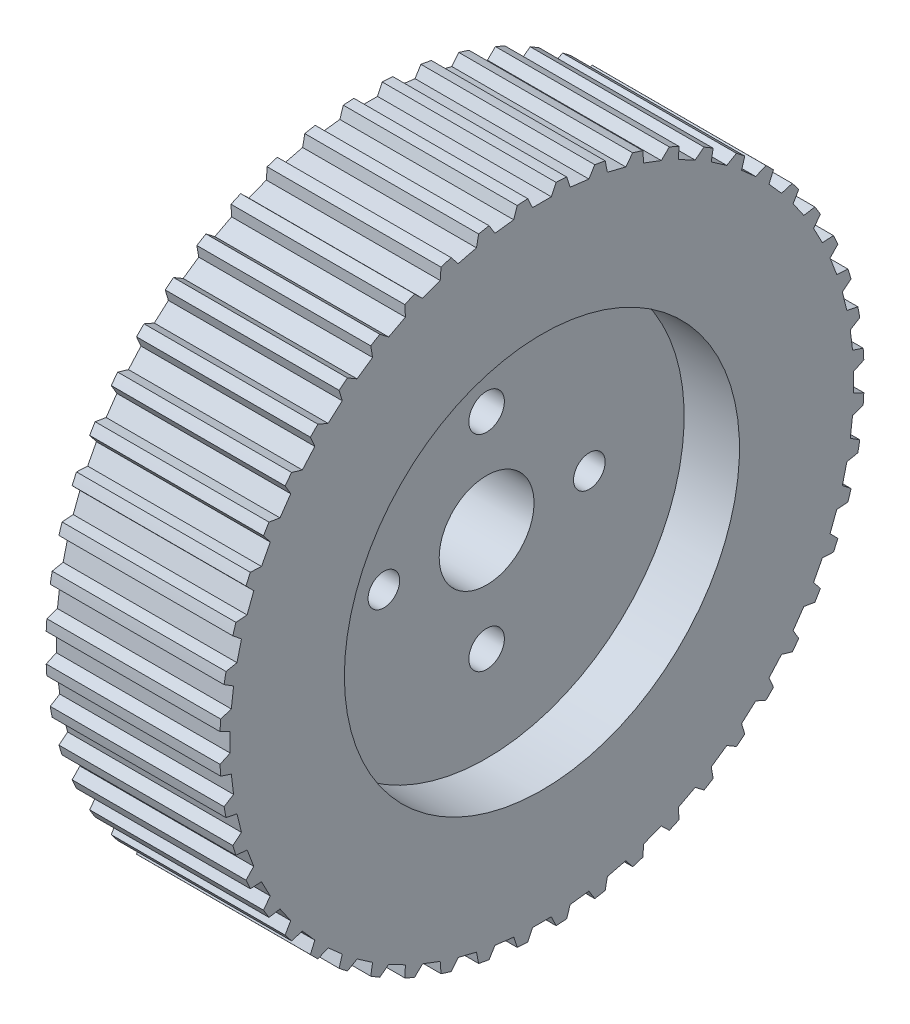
from build123d import *

# Parameters (mm, degrees)
ESQUISSE2_R                  = 2.25
ESQUISSE2_R_2                = 2
ENL_V_MAT_EXTRU_1_DEPTH      = 62.712120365
ENL_V_MAT_EXTRU_2_DEPTH      = 62.712120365
R_P_TITION_CIRCULAIRE1_COUNT = 52


with BuildPart() as part:
    # Esquisse1 → R_volution1 (revolve)
    with BuildSketch(Plane.XY, mode=Mode.PRIVATE) as r_volution1_sk:
        Polygon((0, 25), (7, 25), (7, 40.77), (-15, 40.77), (-15, 6), (0, 6), align=None)
    revolve(r_volution1_sk.sketch.rotate(Axis((-40.008180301, 0, 0), (1, 0, 0)), 90), axis=Axis((-40.008180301, 0, 0), (1, 0, 0)))

    # Esquisse2 → Enl_v. mat.-Extru.1 (cut, through all)
    with BuildSketch(Plane.ZY.offset(15)):
        with Locations((0, 13)):
            Circle(ESQUISSE2_R)
        with Locations((13, 0)):
            Circle(ESQUISSE2_R_2)
        with Locations((0, -13)):
            Circle(ESQUISSE2_R)
        with Locations((-13, 0)):
            Circle(ESQUISSE2_R_2)
    extrude(amount=-ENL_V_MAT_EXTRU_1_DEPTH, mode=Mode.SUBTRACT)

    # Esquisse3 → Enl_v. mat.-Extru.2 (cut, through all)
    with BuildSketch(Plane.ZY.offset(15)):
        Polygon((-2.15, 41.5), (-1.194069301, 39.45), (1.194069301, 39.45), (2.15, 41.5), align=None)
    enl_v_mat_extru_2 = extrude(amount=-ENL_V_MAT_EXTRU_2_DEPTH, mode=Mode.SUBTRACT)

    # R_p_tition circulaire1: Enl_v. mat.-Extru.2 ×52 about axis
    r_p_tition_circulaire1_axis = Axis((0, 0, 0), (1, 0, 0))
    for i in range(1, R_P_TITION_CIRCULAIRE1_COUNT):
        add(enl_v_mat_extru_2.rotate(r_p_tition_circulaire1_axis, i * 360 / R_P_TITION_CIRCULAIRE1_COUNT), mode=Mode.SUBTRACT)


solid = part.part
